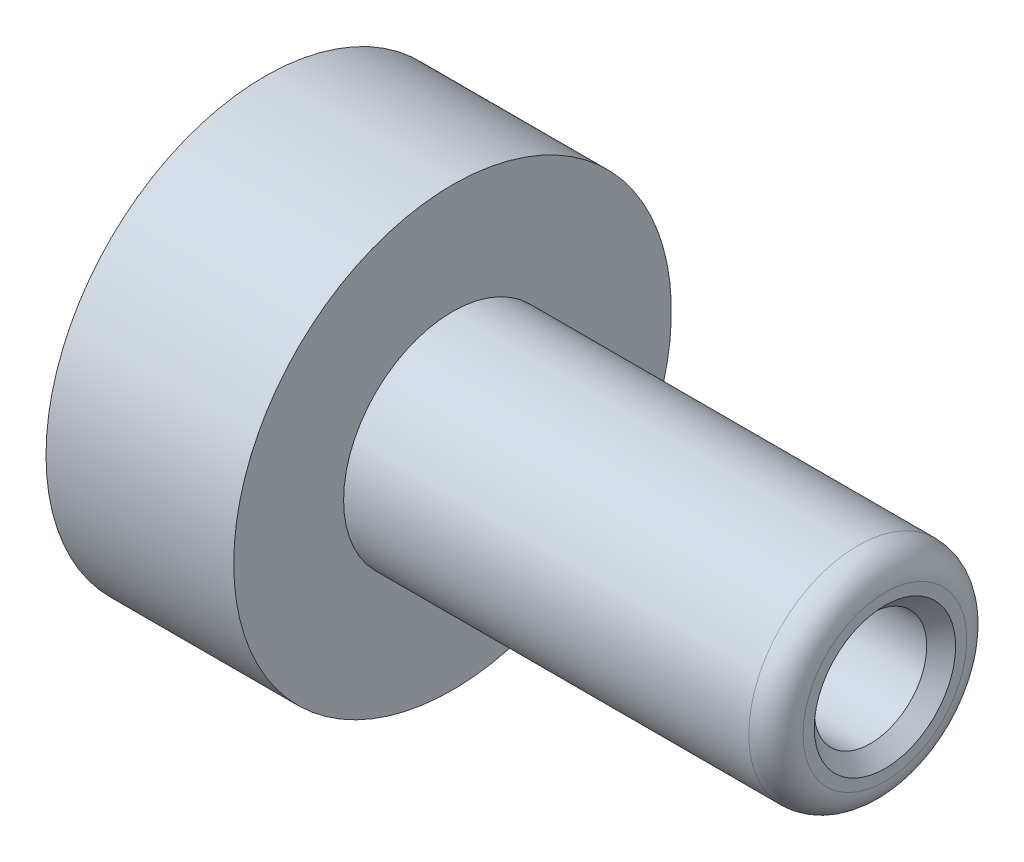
from build123d import *

# Parameters (mm, degrees)
SKETCH2_R          = 1.6129
CUT_EXTRUDE1_DEPTH = 6.35
SKETCH3_R          = 3.2639
CUT_EXTRUDE2_DEPTH = 41.224242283
CHAMFER1_SIZE      = 0.8382


with BuildPart() as part:
    # Sketch1 → Revolve1 (revolve)
    with BuildSketch(Plane.XY, mode=Mode.PRIVATE) as revolve1_sk:
        with BuildLine():
            Line((0, 3.9751), (0, 12.7))
            Line((0, 12.7), (10.8966, 12.7))
            Line((10.8966, 12.7), (10.8966, 6.3246))
            Line((10.8966, 6.3246), (34.417, 6.3246))
            ThreePointArc((34.417, 6.3246), (35.530551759, 5.863351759), (35.9918, 4.7498))
            Line((35.9918, 4.7498), (35.9918, 0))
            Line((35.9918, 0), (21.8948, 0))
            Line((21.8948, 0), (21.8948, 3.9751))
            Line((21.8948, 3.9751), (0, 3.9751))
        make_face()
    revolve(revolve1_sk.sketch.rotate(Axis((0, 0, 0), (1, 0, 0)), 90), axis=Axis((0, 0, 0), (1, 0, 0)))

    # Sketch2 → Cut-Extrude1 (cut)
    with BuildSketch(Plane.ZY):
        with Locations((-7.1374, 0)):
            Circle(SKETCH2_R)
        with Locations(Location((7.1374, 0, 0), (0, 0, 180))):
            Circle(SKETCH2_R)
    extrude(amount=-CUT_EXTRUDE1_DEPTH, mode=Mode.SUBTRACT)

    # Sketch3 → Cut-Extrude2 (cut, through all)
    with BuildSketch(Plane(origin=(35.9918, 0, 0), x_dir=(0, 0, -1), z_dir=(1, 0, 0))):
        Circle(SKETCH3_R)
    extrude(amount=-CUT_EXTRUDE2_DEPTH, mode=Mode.SUBTRACT)

    # Chamfer1
    chamfer1_edges = [part.edges().sort_by_distance(p)[0] for p in [
        (35.9918, 0, 3.2639),
    ]]
    chamfer(chamfer1_edges, length=CHAMFER1_SIZE)


solid = part.part
